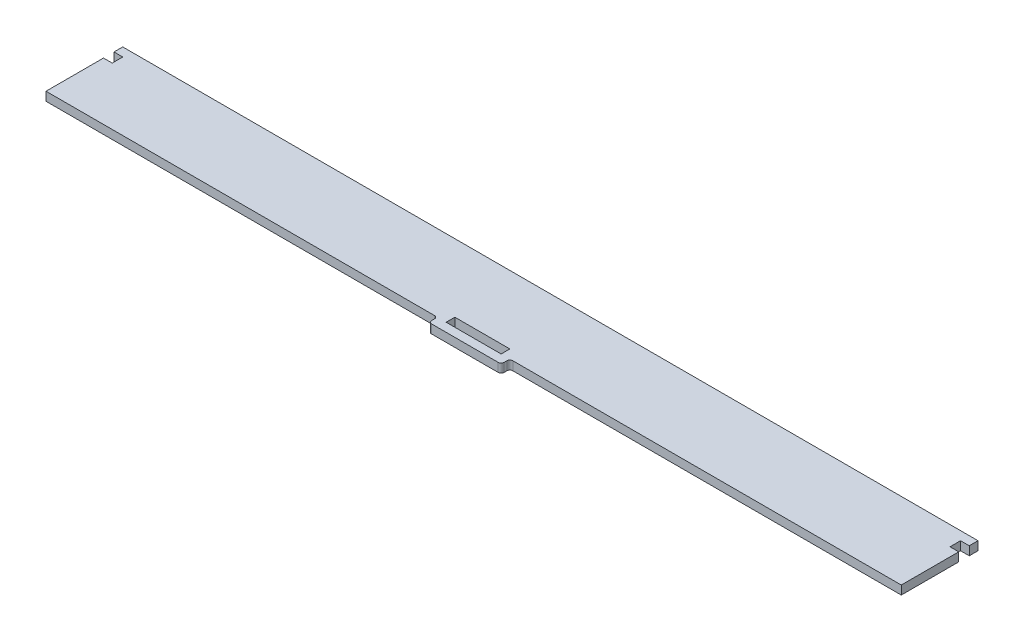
ISO-10303-21;
HEADER;
FILE_DESCRIPTION(('STEP AP214'),'2;1');
FILE_NAME('part.step','',(''),(''),'','','');
FILE_SCHEMA(('AUTOMOTIVE_DESIGN { 1 0 10303 214 1 1 1 1 }'));
ENDSEC;
DATA;
#1=APPLICATION_CONTEXT('core data for automotive mechanical design processes');
#2=APPLICATION_PROTOCOL_DEFINITION('international standard','automotive_design',2000,#1);
#3=PRODUCT_CONTEXT('',#1,'mechanical');
#4=PRODUCT('Part','Part','',(#3));
#5=PRODUCT_RELATED_PRODUCT_CATEGORY('part','',(#4));
#6=PRODUCT_DEFINITION_FORMATION('','',#4);
#7=PRODUCT_DEFINITION_CONTEXT('part definition',#1,'design');
#8=PRODUCT_DEFINITION('design','',#6,#7);
#9=PRODUCT_DEFINITION_SHAPE('','',#8);
#10=(LENGTH_UNIT() NAMED_UNIT(*) SI_UNIT(.MILLI.,.METRE.));
#11=(NAMED_UNIT(*) PLANE_ANGLE_UNIT() SI_UNIT($,.RADIAN.));
#12=(NAMED_UNIT(*) SI_UNIT($,.STERADIAN.) SOLID_ANGLE_UNIT());
#13=UNCERTAINTY_MEASURE_WITH_UNIT(LENGTH_MEASURE(1.E-05),#10,'distance_accuracy_value','');
#14=(GEOMETRIC_REPRESENTATION_CONTEXT(3) GLOBAL_UNCERTAINTY_ASSIGNED_CONTEXT((#13)) GLOBAL_UNIT_ASSIGNED_CONTEXT((#10,
#11,#12)) REPRESENTATION_CONTEXT('',''));
#15=CARTESIAN_POINT('',(0.,0.,0.));
#16=DIRECTION('',(0.,0.,1.));
#17=DIRECTION('',(1.,0.,0.));
#18=AXIS2_PLACEMENT_3D('',#15,#16,#17);
#19=CARTESIAN_POINT('',(14.2333333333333,3.175,2.64583333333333));
#20=DIRECTION('',(0.,1.,0.));
#21=DIRECTION('',(0.,0.,1.));
#22=AXIS2_PLACEMENT_3D('',#19,#20,#21);
#23=PLANE('',#22);
#24=DIRECTION('',(0.,0.,1.));
#25=VECTOR('',#24,1.);
#26=CARTESIAN_POINT('',(-155.575,3.175,1.58750000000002));
#27=LINE('',#26,#25);
#28=CARTESIAN_POINT('',(-155.575,3.175,-19.3223719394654));
#29=VERTEX_POINT('',#28);
#30=CARTESIAN_POINT('',(-155.575,3.175,1.58750000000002));
#31=VERTEX_POINT('',#30);
#32=EDGE_CURVE('E230',#29,#31,#27,.T.);
#33=ORIENTED_EDGE('',*,*,#32,.T.);
#34=DIRECTION('',(1.,0.,0.));
#35=VECTOR('',#34,1.);
#36=CARTESIAN_POINT('',(-14.2333333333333,3.175,1.5875));
#37=LINE('',#36,#35);
#38=CARTESIAN_POINT('',(-14.2333333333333,3.175,1.5875));
#39=VERTEX_POINT('',#38);
#40=EDGE_CURVE('E233',#31,#39,#37,.T.);
#41=ORIENTED_EDGE('',*,*,#40,.T.);
#42=CARTESIAN_POINT('',(-14.2333333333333,3.175,2.64583333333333));
#43=DIRECTION('',(0.,-1.,0.));
#44=DIRECTION('',(0.,0.,-1.));
#45=AXIS2_PLACEMENT_3D('',#42,#43,#44);
#46=CIRCLE('',#45,1.05833333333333);
#47=CARTESIAN_POINT('',(-13.175,3.175,2.64583333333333));
#48=VERTEX_POINT('',#47);
#49=EDGE_CURVE('E236',#39,#48,#46,.T.);
#50=ORIENTED_EDGE('',*,*,#49,.T.);
#51=DIRECTION('',(0.,0.,1.));
#52=VECTOR('',#51,1.);
#53=CARTESIAN_POINT('',(-13.175,3.175,2.64583333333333));
#54=LINE('',#53,#52);
#55=CARTESIAN_POINT('',(-13.175,3.175,3.70416666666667));
#56=VERTEX_POINT('',#55);
#57=EDGE_CURVE('E238',#48,#56,#54,.T.);
#58=ORIENTED_EDGE('',*,*,#57,.T.);
#59=CARTESIAN_POINT('',(-12.1166666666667,3.175,3.70416666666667));
#60=DIRECTION('',(0.,1.,0.));
#61=DIRECTION('',(0.,0.,1.));
#62=AXIS2_PLACEMENT_3D('',#59,#60,#61);
#63=CIRCLE('',#62,1.05833333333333);
#64=CARTESIAN_POINT('',(-12.1166666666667,3.175,4.7625));
#65=VERTEX_POINT('',#64);
#66=EDGE_CURVE('E240',#56,#65,#63,.T.);
#67=ORIENTED_EDGE('',*,*,#66,.T.);
#68=DIRECTION('',(1.,0.,0.));
#69=VECTOR('',#68,1.);
#70=CARTESIAN_POINT('',(-12.1166666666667,3.175,4.7625));
#71=LINE('',#70,#69);
#72=CARTESIAN_POINT('',(12.1166666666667,3.175,4.7625));
#73=VERTEX_POINT('',#72);
#74=EDGE_CURVE('E242',#65,#73,#71,.T.);
#75=ORIENTED_EDGE('',*,*,#74,.T.);
#76=CARTESIAN_POINT('',(12.1166666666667,3.175,3.70416666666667));
#77=DIRECTION('',(0.,1.,0.));
#78=DIRECTION('',(0.,0.,1.));
#79=AXIS2_PLACEMENT_3D('',#76,#77,#78);
#80=CIRCLE('',#79,1.05833333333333);
#81=CARTESIAN_POINT('',(13.175,3.175,3.70416666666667));
#82=VERTEX_POINT('',#81);
#83=EDGE_CURVE('E244',#73,#82,#80,.T.);
#84=ORIENTED_EDGE('',*,*,#83,.T.);
#85=DIRECTION('',(0.,0.,-1.));
#86=VECTOR('',#85,1.);
#87=CARTESIAN_POINT('',(13.175,3.175,2.64583333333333));
#88=LINE('',#87,#86);
#89=CARTESIAN_POINT('',(13.175,3.175,2.64583333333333));
#90=VERTEX_POINT('',#89);
#91=EDGE_CURVE('E246',#82,#90,#88,.T.);
#92=ORIENTED_EDGE('',*,*,#91,.T.);
#93=CARTESIAN_POINT('',(14.2333333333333,3.175,2.64583333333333));
#94=DIRECTION('',(0.,-1.,0.));
#95=DIRECTION('',(0.,0.,1.));
#96=AXIS2_PLACEMENT_3D('',#93,#94,#95);
#97=CIRCLE('',#96,1.05833333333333);
#98=CARTESIAN_POINT('',(14.2333333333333,3.175,1.5875));
#99=VERTEX_POINT('',#98);
#100=EDGE_CURVE('E248',#90,#99,#97,.T.);
#101=ORIENTED_EDGE('',*,*,#100,.T.);
#102=DIRECTION('',(1.,0.,0.));
#103=VECTOR('',#102,1.);
#104=CARTESIAN_POINT('',(155.575,3.175,1.58750000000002));
#105=LINE('',#104,#103);
#106=CARTESIAN_POINT('',(155.575,3.175,1.58750000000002));
#107=VERTEX_POINT('',#106);
#108=EDGE_CURVE('E250',#99,#107,#105,.T.);
#109=ORIENTED_EDGE('',*,*,#108,.T.);
#110=DIRECTION('',(0.,0.,-1.));
#111=VECTOR('',#110,1.);
#112=CARTESIAN_POINT('',(155.575,3.175,-19.3223719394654));
#113=LINE('',#112,#111);
#114=CARTESIAN_POINT('',(155.575,3.175,-19.3223719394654));
#115=VERTEX_POINT('',#114);
#116=EDGE_CURVE('E252',#107,#115,#113,.T.);
#117=ORIENTED_EDGE('',*,*,#116,.T.);
#118=DIRECTION('',(-1.,0.,0.));
#119=VECTOR('',#118,1.);
#120=CARTESIAN_POINT('',(152.4,3.175,-19.3223719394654));
#121=LINE('',#120,#119);
#122=CARTESIAN_POINT('',(152.4,3.175,-19.3223719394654));
#123=VERTEX_POINT('',#122);
#124=EDGE_CURVE('E254',#115,#123,#121,.T.);
#125=ORIENTED_EDGE('',*,*,#124,.T.);
#126=DIRECTION('',(0.,0.,-1.));
#127=VECTOR('',#126,1.);
#128=CARTESIAN_POINT('',(152.4,3.175,-23.1549359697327));
#129=LINE('',#128,#127);
#130=CARTESIAN_POINT('',(152.4,3.175,-23.1549359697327));
#131=VERTEX_POINT('',#130);
#132=EDGE_CURVE('E256',#123,#131,#129,.T.);
#133=ORIENTED_EDGE('',*,*,#132,.T.);
#134=DIRECTION('',(1.,0.,0.));
#135=VECTOR('',#134,1.);
#136=CARTESIAN_POINT('',(155.575,3.175,-23.1549359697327));
#137=LINE('',#136,#135);
#138=CARTESIAN_POINT('',(155.575,3.175,-23.1549359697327));
#139=VERTEX_POINT('',#138);
#140=EDGE_CURVE('E258',#131,#139,#137,.T.);
#141=ORIENTED_EDGE('',*,*,#140,.T.);
#142=DIRECTION('',(0.,0.,-1.));
#143=VECTOR('',#142,1.);
#144=CARTESIAN_POINT('',(155.575,3.175,-26.3299359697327));
#145=LINE('',#144,#143);
#146=CARTESIAN_POINT('',(155.575,3.175,-26.3299359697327));
#147=VERTEX_POINT('',#146);
#148=EDGE_CURVE('E260',#139,#147,#145,.T.);
#149=ORIENTED_EDGE('',*,*,#148,.T.);
#150=DIRECTION('',(-1.,0.,0.));
#151=VECTOR('',#150,1.);
#152=CARTESIAN_POINT('',(152.4,3.175,-26.3299359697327));
#153=LINE('',#152,#151);
#154=CARTESIAN_POINT('',(-155.575,3.175,-26.3299359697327));
#155=VERTEX_POINT('',#154);
#156=EDGE_CURVE('E262',#147,#155,#153,.T.);
#157=ORIENTED_EDGE('',*,*,#156,.T.);
#158=DIRECTION('',(0.,0.,1.));
#159=VECTOR('',#158,1.);
#160=CARTESIAN_POINT('',(-155.575,3.175,-26.3299359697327));
#161=LINE('',#160,#159);
#162=CARTESIAN_POINT('',(-155.575,3.175,-23.1549359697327));
#163=VERTEX_POINT('',#162);
#164=EDGE_CURVE('E264',#155,#163,#161,.T.);
#165=ORIENTED_EDGE('',*,*,#164,.T.);
#166=DIRECTION('',(1.,0.,0.));
#167=VECTOR('',#166,1.);
#168=CARTESIAN_POINT('',(-155.575,3.175,-23.1549359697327));
#169=LINE('',#168,#167);
#170=CARTESIAN_POINT('',(-152.4,3.175,-23.1549359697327));
#171=VERTEX_POINT('',#170);
#172=EDGE_CURVE('E266',#163,#171,#169,.T.);
#173=ORIENTED_EDGE('',*,*,#172,.T.);
#174=DIRECTION('',(0.,0.,1.));
#175=VECTOR('',#174,1.);
#176=CARTESIAN_POINT('',(-152.4,3.175,-23.1549359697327));
#177=LINE('',#176,#175);
#178=CARTESIAN_POINT('',(-152.4,3.175,-19.3223719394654));
#179=VERTEX_POINT('',#178);
#180=EDGE_CURVE('E268',#171,#179,#177,.T.);
#181=ORIENTED_EDGE('',*,*,#180,.T.);
#182=DIRECTION('',(-1.,0.,0.));
#183=VECTOR('',#182,1.);
#184=CARTESIAN_POINT('',(-155.575,3.175,-19.3223719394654));
#185=LINE('',#184,#183);
#186=EDGE_CURVE('E270',#179,#29,#185,.T.);
#187=ORIENTED_EDGE('',*,*,#186,.T.);
#188=EDGE_LOOP('',(#33,#41,#50,#58,#67,#75,#84,#92,#101,#109,#117,#125,#133,#141,#149,#157,#165,
#173,#181,#187));
#189=FACE_BOUND('',#188,.T.);
#190=DIRECTION('',(-1.,0.,0.));
#191=VECTOR('',#190,1.);
#192=CARTESIAN_POINT('',(-10.,3.175,-1.5875));
#193=LINE('',#192,#191);
#194=CARTESIAN_POINT('',(10.,3.175,-1.5875));
#195=VERTEX_POINT('',#194);
#196=CARTESIAN_POINT('',(-10.,3.175,-1.5875));
#197=VERTEX_POINT('',#196);
#198=EDGE_CURVE('E202',#195,#197,#193,.T.);
#199=ORIENTED_EDGE('',*,*,#198,.F.);
#200=DIRECTION('',(0.,0.,-1.));
#201=VECTOR('',#200,1.);
#202=CARTESIAN_POINT('',(10.,3.175,1.5875));
#203=LINE('',#202,#201);
#204=CARTESIAN_POINT('',(10.,3.175,1.5875));
#205=VERTEX_POINT('',#204);
#206=EDGE_CURVE('E194',#205,#195,#203,.T.);
#207=ORIENTED_EDGE('',*,*,#206,.F.);
#208=DIRECTION('',(1.,0.,0.));
#209=VECTOR('',#208,1.);
#210=CARTESIAN_POINT('',(-10.,3.175,1.5875));
#211=LINE('',#210,#209);
#212=CARTESIAN_POINT('',(-10.,3.175,1.5875));
#213=VERTEX_POINT('',#212);
#214=EDGE_CURVE('E216',#213,#205,#211,.T.);
#215=ORIENTED_EDGE('',*,*,#214,.F.);
#216=DIRECTION('',(0.,0.,1.));
#217=VECTOR('',#216,1.);
#218=CARTESIAN_POINT('',(-10.,3.175,1.5875));
#219=LINE('',#218,#217);
#220=EDGE_CURVE('E214',#197,#213,#219,.T.);
#221=ORIENTED_EDGE('',*,*,#220,.F.);
#222=EDGE_LOOP('',(#199,#207,#215,#221));
#223=FACE_BOUND('',#222,.T.);
#224=ADVANCED_FACE('F33',(#189,#223),#23,.T.);
#225=CARTESIAN_POINT('',(14.2333333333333,0.,2.64583333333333));
#226=DIRECTION('',(0.,1.,0.));
#227=DIRECTION('',(0.,0.,1.));
#228=AXIS2_PLACEMENT_3D('',#225,#226,#227);
#229=PLANE('',#228);
#230=DIRECTION('',(0.,0.,1.));
#231=VECTOR('',#230,1.);
#232=CARTESIAN_POINT('',(-155.575,0.,1.58750000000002));
#233=LINE('',#232,#231);
#234=CARTESIAN_POINT('',(-155.575,0.,-19.3223719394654));
#235=VERTEX_POINT('',#234);
#236=CARTESIAN_POINT('',(-155.575,0.,1.58750000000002));
#237=VERTEX_POINT('',#236);
#238=EDGE_CURVE('E210',#235,#237,#233,.T.);
#239=ORIENTED_EDGE('',*,*,#238,.F.);
#240=DIRECTION('',(-1.,0.,0.));
#241=VECTOR('',#240,1.);
#242=CARTESIAN_POINT('',(-155.575,0.,-19.3223719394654));
#243=LINE('',#242,#241);
#244=CARTESIAN_POINT('',(-152.4,0.,-19.3223719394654));
#245=VERTEX_POINT('',#244);
#246=EDGE_CURVE('E234',#245,#235,#243,.T.);
#247=ORIENTED_EDGE('',*,*,#246,.F.);
#248=DIRECTION('',(0.,0.,1.));
#249=VECTOR('',#248,1.);
#250=CARTESIAN_POINT('',(-152.4,0.,-23.1549359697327));
#251=LINE('',#250,#249);
#252=CARTESIAN_POINT('',(-152.4,0.,-23.1549359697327));
#253=VERTEX_POINT('',#252);
#254=EDGE_CURVE('E310',#253,#245,#251,.T.);
#255=ORIENTED_EDGE('',*,*,#254,.F.);
#256=DIRECTION('',(1.,0.,0.));
#257=VECTOR('',#256,1.);
#258=CARTESIAN_POINT('',(-155.575,0.,-23.1549359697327));
#259=LINE('',#258,#257);
#260=CARTESIAN_POINT('',(-155.575,0.,-23.1549359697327));
#261=VERTEX_POINT('',#260);
#262=EDGE_CURVE('E308',#261,#253,#259,.T.);
#263=ORIENTED_EDGE('',*,*,#262,.F.);
#264=DIRECTION('',(0.,0.,1.));
#265=VECTOR('',#264,1.);
#266=CARTESIAN_POINT('',(-155.575,0.,-26.3299359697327));
#267=LINE('',#266,#265);
#268=CARTESIAN_POINT('',(-155.575,0.,-26.3299359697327));
#269=VERTEX_POINT('',#268);
#270=EDGE_CURVE('E306',#269,#261,#267,.T.);
#271=ORIENTED_EDGE('',*,*,#270,.F.);
#272=DIRECTION('',(-1.,0.,0.));
#273=VECTOR('',#272,1.);
#274=CARTESIAN_POINT('',(-152.4,0.,-26.3299359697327));
#275=LINE('',#274,#273);
#276=CARTESIAN_POINT('',(155.575,0.,-26.3299359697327));
#277=VERTEX_POINT('',#276);
#278=EDGE_CURVE('E304',#277,#269,#275,.T.);
#279=ORIENTED_EDGE('',*,*,#278,.F.);
#280=DIRECTION('',(0.,0.,-1.));
#281=VECTOR('',#280,1.);
#282=CARTESIAN_POINT('',(155.575,0.,-26.3299359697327));
#283=LINE('',#282,#281);
#284=CARTESIAN_POINT('',(155.575,0.,-23.1549359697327));
#285=VERTEX_POINT('',#284);
#286=EDGE_CURVE('E301',#285,#277,#283,.T.);
#287=ORIENTED_EDGE('',*,*,#286,.F.);
#288=DIRECTION('',(1.,0.,0.));
#289=VECTOR('',#288,1.);
#290=CARTESIAN_POINT('',(155.575,0.,-23.1549359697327));
#291=LINE('',#290,#289);
#292=CARTESIAN_POINT('',(152.4,0.,-23.1549359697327));
#293=VERTEX_POINT('',#292);
#294=EDGE_CURVE('E299',#293,#285,#291,.T.);
#295=ORIENTED_EDGE('',*,*,#294,.F.);
#296=DIRECTION('',(0.,0.,-1.));
#297=VECTOR('',#296,1.);
#298=CARTESIAN_POINT('',(152.4,0.,-23.1549359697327));
#299=LINE('',#298,#297);
#300=CARTESIAN_POINT('',(152.4,0.,-19.3223719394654));
#301=VERTEX_POINT('',#300);
#302=EDGE_CURVE('E297',#301,#293,#299,.T.);
#303=ORIENTED_EDGE('',*,*,#302,.F.);
#304=DIRECTION('',(-1.,0.,0.));
#305=VECTOR('',#304,1.);
#306=CARTESIAN_POINT('',(152.4,0.,-19.3223719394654));
#307=LINE('',#306,#305);
#308=CARTESIAN_POINT('',(155.575,0.,-19.3223719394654));
#309=VERTEX_POINT('',#308);
#310=EDGE_CURVE('E295',#309,#301,#307,.T.);
#311=ORIENTED_EDGE('',*,*,#310,.F.);
#312=DIRECTION('',(0.,0.,-1.));
#313=VECTOR('',#312,1.);
#314=CARTESIAN_POINT('',(155.575,0.,-19.3223719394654));
#315=LINE('',#314,#313);
#316=CARTESIAN_POINT('',(155.575,0.,1.58750000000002));
#317=VERTEX_POINT('',#316);
#318=EDGE_CURVE('E293',#317,#309,#315,.T.);
#319=ORIENTED_EDGE('',*,*,#318,.F.);
#320=DIRECTION('',(1.,0.,0.));
#321=VECTOR('',#320,1.);
#322=CARTESIAN_POINT('',(155.575,0.,1.58750000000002));
#323=LINE('',#322,#321);
#324=CARTESIAN_POINT('',(14.2333333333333,0.,1.5875));
#325=VERTEX_POINT('',#324);
#326=EDGE_CURVE('E291',#325,#317,#323,.T.);
#327=ORIENTED_EDGE('',*,*,#326,.F.);
#328=CARTESIAN_POINT('',(14.2333333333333,0.,2.64583333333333));
#329=DIRECTION('',(0.,-1.,0.));
#330=DIRECTION('',(0.,0.,1.));
#331=AXIS2_PLACEMENT_3D('',#328,#329,#330);
#332=CIRCLE('',#331,1.05833333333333);
#333=CARTESIAN_POINT('',(13.175,0.,2.64583333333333));
#334=VERTEX_POINT('',#333);
#335=EDGE_CURVE('E289',#334,#325,#332,.T.);
#336=ORIENTED_EDGE('',*,*,#335,.F.);
#337=DIRECTION('',(0.,0.,-1.));
#338=VECTOR('',#337,1.);
#339=CARTESIAN_POINT('',(13.175,0.,2.64583333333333));
#340=LINE('',#339,#338);
#341=CARTESIAN_POINT('',(13.175,0.,3.70416666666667));
#342=VERTEX_POINT('',#341);
#343=EDGE_CURVE('E287',#342,#334,#340,.T.);
#344=ORIENTED_EDGE('',*,*,#343,.F.);
#345=CARTESIAN_POINT('',(12.1166666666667,0.,3.70416666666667));
#346=DIRECTION('',(0.,1.,0.));
#347=DIRECTION('',(0.,0.,1.));
#348=AXIS2_PLACEMENT_3D('',#345,#346,#347);
#349=CIRCLE('',#348,1.05833333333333);
#350=CARTESIAN_POINT('',(12.1166666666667,0.,4.7625));
#351=VERTEX_POINT('',#350);
#352=EDGE_CURVE('E285',#351,#342,#349,.T.);
#353=ORIENTED_EDGE('',*,*,#352,.F.);
#354=DIRECTION('',(1.,0.,0.));
#355=VECTOR('',#354,1.);
#356=CARTESIAN_POINT('',(-12.1166666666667,0.,4.7625));
#357=LINE('',#356,#355);
#358=CARTESIAN_POINT('',(-12.1166666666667,0.,4.7625));
#359=VERTEX_POINT('',#358);
#360=EDGE_CURVE('E283',#359,#351,#357,.T.);
#361=ORIENTED_EDGE('',*,*,#360,.F.);
#362=CARTESIAN_POINT('',(-12.1166666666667,0.,3.70416666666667));
#363=DIRECTION('',(0.,1.,0.));
#364=DIRECTION('',(0.,0.,1.));
#365=AXIS2_PLACEMENT_3D('',#362,#363,#364);
#366=CIRCLE('',#365,1.05833333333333);
#367=CARTESIAN_POINT('',(-13.175,0.,3.70416666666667));
#368=VERTEX_POINT('',#367);
#369=EDGE_CURVE('E281',#368,#359,#366,.T.);
#370=ORIENTED_EDGE('',*,*,#369,.F.);
#371=DIRECTION('',(0.,0.,1.));
#372=VECTOR('',#371,1.);
#373=CARTESIAN_POINT('',(-13.175,0.,2.64583333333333));
#374=LINE('',#373,#372);
#375=CARTESIAN_POINT('',(-13.175,0.,2.64583333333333));
#376=VERTEX_POINT('',#375);
#377=EDGE_CURVE('E279',#376,#368,#374,.T.);
#378=ORIENTED_EDGE('',*,*,#377,.F.);
#379=CARTESIAN_POINT('',(-14.2333333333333,0.,2.64583333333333));
#380=DIRECTION('',(0.,-1.,0.));
#381=DIRECTION('',(0.,0.,-1.));
#382=AXIS2_PLACEMENT_3D('',#379,#380,#381);
#383=CIRCLE('',#382,1.05833333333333);
#384=CARTESIAN_POINT('',(-14.2333333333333,0.,1.5875));
#385=VERTEX_POINT('',#384);
#386=EDGE_CURVE('E277',#385,#376,#383,.T.);
#387=ORIENTED_EDGE('',*,*,#386,.F.);
#388=DIRECTION('',(1.,0.,0.));
#389=VECTOR('',#388,1.);
#390=CARTESIAN_POINT('',(-14.2333333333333,0.,1.5875));
#391=LINE('',#390,#389);
#392=EDGE_CURVE('E275',#237,#385,#391,.T.);
#393=ORIENTED_EDGE('',*,*,#392,.F.);
#394=EDGE_LOOP('',(#239,#247,#255,#263,#271,#279,#287,#295,#303,#311,#319,#327,#336,#344,#353,
#361,#370,#378,#387,#393));
#395=FACE_BOUND('',#394,.T.);
#396=DIRECTION('',(0.,0.,-1.));
#397=VECTOR('',#396,1.);
#398=CARTESIAN_POINT('',(10.,0.,1.5875));
#399=LINE('',#398,#397);
#400=CARTESIAN_POINT('',(10.,0.,1.5875));
#401=VERTEX_POINT('',#400);
#402=CARTESIAN_POINT('',(10.,0.,-1.5875));
#403=VERTEX_POINT('',#402);
#404=EDGE_CURVE('E56',#401,#403,#399,.T.);
#405=ORIENTED_EDGE('',*,*,#404,.T.);
#406=DIRECTION('',(-1.,0.,0.));
#407=VECTOR('',#406,1.);
#408=CARTESIAN_POINT('',(-10.,0.,-1.5875));
#409=LINE('',#408,#407);
#410=CARTESIAN_POINT('',(-10.,0.,-1.5875));
#411=VERTEX_POINT('',#410);
#412=EDGE_CURVE('E209',#403,#411,#409,.T.);
#413=ORIENTED_EDGE('',*,*,#412,.T.);
#414=DIRECTION('',(0.,0.,1.));
#415=VECTOR('',#414,1.);
#416=CARTESIAN_POINT('',(-10.,0.,1.5875));
#417=LINE('',#416,#415);
#418=CARTESIAN_POINT('',(-10.,0.,1.5875));
#419=VERTEX_POINT('',#418);
#420=EDGE_CURVE('E222',#411,#419,#417,.T.);
#421=ORIENTED_EDGE('',*,*,#420,.T.);
#422=DIRECTION('',(1.,0.,0.));
#423=VECTOR('',#422,1.);
#424=CARTESIAN_POINT('',(-10.,0.,1.5875));
#425=LINE('',#424,#423);
#426=EDGE_CURVE('E203',#419,#401,#425,.T.);
#427=ORIENTED_EDGE('',*,*,#426,.T.);
#428=EDGE_LOOP('',(#405,#413,#421,#427));
#429=FACE_BOUND('',#428,.T.);
#430=ADVANCED_FACE('F376',(#395,#429),#229,.F.);
#431=CARTESIAN_POINT('',(-155.575,3.175,1.58750000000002));
#432=DIRECTION('',(1.,0.,0.));
#433=DIRECTION('',(0.,0.,-1.));
#434=AXIS2_PLACEMENT_3D('',#431,#432,#433);
#435=PLANE('',#434);
#436=ORIENTED_EDGE('',*,*,#238,.T.);
#437=DIRECTION('',(0.,-1.,0.));
#438=VECTOR('',#437,1.);
#439=CARTESIAN_POINT('',(-155.575,3.175,1.58750000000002));
#440=LINE('',#439,#438);
#441=EDGE_CURVE('E11',#31,#237,#440,.T.);
#442=ORIENTED_EDGE('',*,*,#441,.F.);
#443=ORIENTED_EDGE('',*,*,#32,.F.);
#444=DIRECTION('',(0.,-1.,0.));
#445=VECTOR('',#444,1.);
#446=CARTESIAN_POINT('',(-155.575,3.175,-19.3223719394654));
#447=LINE('',#446,#445);
#448=EDGE_CURVE('E272',#29,#235,#447,.T.);
#449=ORIENTED_EDGE('',*,*,#448,.T.);
#450=EDGE_LOOP('',(#436,#442,#443,#449));
#451=FACE_BOUND('',#450,.T.);
#452=ADVANCED_FACE('F35',(#451),#435,.F.);
#453=CARTESIAN_POINT('',(-14.2333333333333,3.175,1.5875));
#454=DIRECTION('',(0.,0.,-1.));
#455=DIRECTION('',(-1.,0.,0.));
#456=AXIS2_PLACEMENT_3D('',#453,#454,#455);
#457=PLANE('',#456);
#458=ORIENTED_EDGE('',*,*,#392,.T.);
#459=DIRECTION('',(0.,-1.,0.));
#460=VECTOR('',#459,1.);
#461=CARTESIAN_POINT('',(-14.2333333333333,3.175,1.5875));
#462=LINE('',#461,#460);
#463=EDGE_CURVE('E41',#39,#385,#462,.T.);
#464=ORIENTED_EDGE('',*,*,#463,.F.);
#465=ORIENTED_EDGE('',*,*,#40,.F.);
#466=ORIENTED_EDGE('',*,*,#441,.T.);
#467=EDGE_LOOP('',(#458,#464,#465,#466));
#468=FACE_BOUND('',#467,.T.);
#469=ADVANCED_FACE('F393',(#468),#457,.F.);
#470=CARTESIAN_POINT('',(-14.2333333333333,3.175,2.64583333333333));
#471=DIRECTION('',(0.,-1.,0.));
#472=DIRECTION('',(0.,0.,-1.));
#473=AXIS2_PLACEMENT_3D('',#470,#471,#472);
#474=CYLINDRICAL_SURFACE('',#473,1.05833333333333);
#475=ORIENTED_EDGE('',*,*,#386,.T.);
#476=DIRECTION('',(0.,-1.,0.));
#477=VECTOR('',#476,1.);
#478=CARTESIAN_POINT('',(-13.175,3.175,2.64583333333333));
#479=LINE('',#478,#477);
#480=EDGE_CURVE('E363',#48,#376,#479,.T.);
#481=ORIENTED_EDGE('',*,*,#480,.F.);
#482=ORIENTED_EDGE('',*,*,#49,.F.);
#483=ORIENTED_EDGE('',*,*,#463,.T.);
#484=EDGE_LOOP('',(#475,#481,#482,#483));
#485=FACE_BOUND('',#484,.T.);
#486=ADVANCED_FACE('F370',(#485),#474,.F.);
#487=CARTESIAN_POINT('',(-13.175,3.175,2.64583333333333));
#488=DIRECTION('',(1.,0.,0.));
#489=DIRECTION('',(0.,0.,-1.));
#490=AXIS2_PLACEMENT_3D('',#487,#488,#489);
#491=PLANE('',#490);
#492=ORIENTED_EDGE('',*,*,#377,.T.);
#493=DIRECTION('',(0.,-1.,0.));
#494=VECTOR('',#493,1.);
#495=CARTESIAN_POINT('',(-13.175,3.175,3.70416666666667));
#496=LINE('',#495,#494);
#497=EDGE_CURVE('E360',#56,#368,#496,.T.);
#498=ORIENTED_EDGE('',*,*,#497,.F.);
#499=ORIENTED_EDGE('',*,*,#57,.F.);
#500=ORIENTED_EDGE('',*,*,#480,.T.);
#501=EDGE_LOOP('',(#492,#498,#499,#500));
#502=FACE_BOUND('',#501,.T.);
#503=ADVANCED_FACE('F382',(#502),#491,.F.);
#504=CARTESIAN_POINT('',(-12.1166666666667,3.175,3.70416666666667));
#505=DIRECTION('',(0.,-1.,0.));
#506=DIRECTION('',(0.,0.,-1.));
#507=AXIS2_PLACEMENT_3D('',#504,#505,#506);
#508=CYLINDRICAL_SURFACE('',#507,1.05833333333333);
#509=ORIENTED_EDGE('',*,*,#369,.T.);
#510=DIRECTION('',(0.,-1.,0.));
#511=VECTOR('',#510,1.);
#512=CARTESIAN_POINT('',(-12.1166666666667,3.175,4.7625));
#513=LINE('',#512,#511);
#514=EDGE_CURVE('E357',#65,#359,#513,.T.);
#515=ORIENTED_EDGE('',*,*,#514,.F.);
#516=ORIENTED_EDGE('',*,*,#66,.F.);
#517=ORIENTED_EDGE('',*,*,#497,.T.);
#518=EDGE_LOOP('',(#509,#515,#516,#517));
#519=FACE_BOUND('',#518,.T.);
#520=ADVANCED_FACE('F386',(#519),#508,.T.);
#521=CARTESIAN_POINT('',(-12.1166666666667,3.175,4.7625));
#522=DIRECTION('',(0.,0.,-1.));
#523=DIRECTION('',(-1.,0.,0.));
#524=AXIS2_PLACEMENT_3D('',#521,#522,#523);
#525=PLANE('',#524);
#526=ORIENTED_EDGE('',*,*,#360,.T.);
#527=DIRECTION('',(0.,-1.,0.));
#528=VECTOR('',#527,1.);
#529=CARTESIAN_POINT('',(12.1166666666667,3.175,4.7625));
#530=LINE('',#529,#528);
#531=EDGE_CURVE('E354',#73,#351,#530,.T.);
#532=ORIENTED_EDGE('',*,*,#531,.F.);
#533=ORIENTED_EDGE('',*,*,#74,.F.);
#534=ORIENTED_EDGE('',*,*,#514,.T.);
#535=EDGE_LOOP('',(#526,#532,#533,#534));
#536=FACE_BOUND('',#535,.T.);
#537=ADVANCED_FACE('F465',(#536),#525,.F.);
#538=CARTESIAN_POINT('',(12.1166666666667,3.175,3.70416666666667));
#539=DIRECTION('',(0.,-1.,0.));
#540=DIRECTION('',(0.,0.,-1.));
#541=AXIS2_PLACEMENT_3D('',#538,#539,#540);
#542=CYLINDRICAL_SURFACE('',#541,1.05833333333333);
#543=ORIENTED_EDGE('',*,*,#352,.T.);
#544=DIRECTION('',(0.,-1.,0.));
#545=VECTOR('',#544,1.);
#546=CARTESIAN_POINT('',(13.175,3.175,3.70416666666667));
#547=LINE('',#546,#545);
#548=EDGE_CURVE('E351',#82,#342,#547,.T.);
#549=ORIENTED_EDGE('',*,*,#548,.F.);
#550=ORIENTED_EDGE('',*,*,#83,.F.);
#551=ORIENTED_EDGE('',*,*,#531,.T.);
#552=EDGE_LOOP('',(#543,#549,#550,#551));
#553=FACE_BOUND('',#552,.T.);
#554=ADVANCED_FACE('F463',(#553),#542,.T.);
#555=CARTESIAN_POINT('',(13.175,3.175,2.64583333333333));
#556=DIRECTION('',(-1.,0.,0.));
#557=DIRECTION('',(0.,0.,1.));
#558=AXIS2_PLACEMENT_3D('',#555,#556,#557);
#559=PLANE('',#558);
#560=ORIENTED_EDGE('',*,*,#343,.T.);
#561=DIRECTION('',(0.,-1.,0.));
#562=VECTOR('',#561,1.);
#563=CARTESIAN_POINT('',(13.175,3.175,2.64583333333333));
#564=LINE('',#563,#562);
#565=EDGE_CURVE('E348',#90,#334,#564,.T.);
#566=ORIENTED_EDGE('',*,*,#565,.F.);
#567=ORIENTED_EDGE('',*,*,#91,.F.);
#568=ORIENTED_EDGE('',*,*,#548,.T.);
#569=EDGE_LOOP('',(#560,#566,#567,#568));
#570=FACE_BOUND('',#569,.T.);
#571=ADVANCED_FACE('F458',(#570),#559,.F.);
#572=CARTESIAN_POINT('',(14.2333333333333,3.175,2.64583333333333));
#573=DIRECTION('',(0.,-1.,0.));
#574=DIRECTION('',(0.,0.,-1.));
#575=AXIS2_PLACEMENT_3D('',#572,#573,#574);
#576=CYLINDRICAL_SURFACE('',#575,1.05833333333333);
#577=ORIENTED_EDGE('',*,*,#335,.T.);
#578=DIRECTION('',(0.,-1.,0.));
#579=VECTOR('',#578,1.);
#580=CARTESIAN_POINT('',(14.2333333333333,3.175,1.5875));
#581=LINE('',#580,#579);
#582=EDGE_CURVE('E345',#99,#325,#581,.T.);
#583=ORIENTED_EDGE('',*,*,#582,.F.);
#584=ORIENTED_EDGE('',*,*,#100,.F.);
#585=ORIENTED_EDGE('',*,*,#565,.T.);
#586=EDGE_LOOP('',(#577,#583,#584,#585));
#587=FACE_BOUND('',#586,.T.);
#588=ADVANCED_FACE('F453',(#587),#576,.F.);
#589=CARTESIAN_POINT('',(155.575,3.175,1.58750000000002));
#590=DIRECTION('',(0.,0.,-1.));
#591=DIRECTION('',(-1.,0.,0.));
#592=AXIS2_PLACEMENT_3D('',#589,#590,#591);
#593=PLANE('',#592);
#594=ORIENTED_EDGE('',*,*,#326,.T.);
#595=DIRECTION('',(0.,-1.,0.));
#596=VECTOR('',#595,1.);
#597=CARTESIAN_POINT('',(155.575,3.175,1.58750000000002));
#598=LINE('',#597,#596);
#599=EDGE_CURVE('E342',#107,#317,#598,.T.);
#600=ORIENTED_EDGE('',*,*,#599,.F.);
#601=ORIENTED_EDGE('',*,*,#108,.F.);
#602=ORIENTED_EDGE('',*,*,#582,.T.);
#603=EDGE_LOOP('',(#594,#600,#601,#602));
#604=FACE_BOUND('',#603,.T.);
#605=ADVANCED_FACE('F449',(#604),#593,.F.);
#606=CARTESIAN_POINT('',(155.575,3.175,-19.3223719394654));
#607=DIRECTION('',(-1.,0.,0.));
#608=DIRECTION('',(0.,0.,1.));
#609=AXIS2_PLACEMENT_3D('',#606,#607,#608);
#610=PLANE('',#609);
#611=ORIENTED_EDGE('',*,*,#318,.T.);
#612=DIRECTION('',(0.,-1.,0.));
#613=VECTOR('',#612,1.);
#614=CARTESIAN_POINT('',(155.575,3.175,-19.3223719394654));
#615=LINE('',#614,#613);
#616=EDGE_CURVE('E339',#115,#309,#615,.T.);
#617=ORIENTED_EDGE('',*,*,#616,.F.);
#618=ORIENTED_EDGE('',*,*,#116,.F.);
#619=ORIENTED_EDGE('',*,*,#599,.T.);
#620=EDGE_LOOP('',(#611,#617,#618,#619));
#621=FACE_BOUND('',#620,.T.);
#622=ADVANCED_FACE('F444',(#621),#610,.F.);
#623=CARTESIAN_POINT('',(152.4,3.175,-19.3223719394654));
#624=DIRECTION('',(0.,0.,1.));
#625=DIRECTION('',(1.,0.,0.));
#626=AXIS2_PLACEMENT_3D('',#623,#624,#625);
#627=PLANE('',#626);
#628=ORIENTED_EDGE('',*,*,#310,.T.);
#629=DIRECTION('',(0.,-1.,0.));
#630=VECTOR('',#629,1.);
#631=CARTESIAN_POINT('',(152.4,3.175,-19.3223719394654));
#632=LINE('',#631,#630);
#633=EDGE_CURVE('E336',#123,#301,#632,.T.);
#634=ORIENTED_EDGE('',*,*,#633,.F.);
#635=ORIENTED_EDGE('',*,*,#124,.F.);
#636=ORIENTED_EDGE('',*,*,#616,.T.);
#637=EDGE_LOOP('',(#628,#634,#635,#636));
#638=FACE_BOUND('',#637,.T.);
#639=ADVANCED_FACE('F438',(#638),#627,.F.);
#640=CARTESIAN_POINT('',(152.4,3.175,-23.1549359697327));
#641=DIRECTION('',(-1.,0.,0.));
#642=DIRECTION('',(0.,0.,1.));
#643=AXIS2_PLACEMENT_3D('',#640,#641,#642);
#644=PLANE('',#643);
#645=ORIENTED_EDGE('',*,*,#302,.T.);
#646=DIRECTION('',(0.,-1.,0.));
#647=VECTOR('',#646,1.);
#648=CARTESIAN_POINT('',(152.4,3.175,-23.1549359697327));
#649=LINE('',#648,#647);
#650=EDGE_CURVE('E333',#131,#293,#649,.T.);
#651=ORIENTED_EDGE('',*,*,#650,.F.);
#652=ORIENTED_EDGE('',*,*,#132,.F.);
#653=ORIENTED_EDGE('',*,*,#633,.T.);
#654=EDGE_LOOP('',(#645,#651,#652,#653));
#655=FACE_BOUND('',#654,.T.);
#656=ADVANCED_FACE('F434',(#655),#644,.F.);
#657=CARTESIAN_POINT('',(155.575,3.175,-23.1549359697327));
#658=DIRECTION('',(0.,0.,-1.));
#659=DIRECTION('',(-1.,0.,0.));
#660=AXIS2_PLACEMENT_3D('',#657,#658,#659);
#661=PLANE('',#660);
#662=ORIENTED_EDGE('',*,*,#294,.T.);
#663=DIRECTION('',(0.,-1.,0.));
#664=VECTOR('',#663,1.);
#665=CARTESIAN_POINT('',(155.575,3.175,-23.1549359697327));
#666=LINE('',#665,#664);
#667=EDGE_CURVE('E330',#139,#285,#666,.T.);
#668=ORIENTED_EDGE('',*,*,#667,.F.);
#669=ORIENTED_EDGE('',*,*,#140,.F.);
#670=ORIENTED_EDGE('',*,*,#650,.T.);
#671=EDGE_LOOP('',(#662,#668,#669,#670));
#672=FACE_BOUND('',#671,.T.);
#673=ADVANCED_FACE('F429',(#672),#661,.F.);
#674=CARTESIAN_POINT('',(155.575,3.175,-26.3299359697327));
#675=DIRECTION('',(-1.,0.,0.));
#676=DIRECTION('',(0.,0.,1.));
#677=AXIS2_PLACEMENT_3D('',#674,#675,#676);
#678=PLANE('',#677);
#679=ORIENTED_EDGE('',*,*,#286,.T.);
#680=DIRECTION('',(0.,-1.,0.));
#681=VECTOR('',#680,1.);
#682=CARTESIAN_POINT('',(155.575,3.175,-26.3299359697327));
#683=LINE('',#682,#681);
#684=EDGE_CURVE('E327',#147,#277,#683,.T.);
#685=ORIENTED_EDGE('',*,*,#684,.F.);
#686=ORIENTED_EDGE('',*,*,#148,.F.);
#687=ORIENTED_EDGE('',*,*,#667,.T.);
#688=EDGE_LOOP('',(#679,#685,#686,#687));
#689=FACE_BOUND('',#688,.T.);
#690=ADVANCED_FACE('F423',(#689),#678,.F.);
#691=CARTESIAN_POINT('',(-152.4,3.175,-26.3299359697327));
#692=DIRECTION('',(0.,0.,1.));
#693=DIRECTION('',(1.,0.,0.));
#694=AXIS2_PLACEMENT_3D('',#691,#692,#693);
#695=PLANE('',#694);
#696=ORIENTED_EDGE('',*,*,#278,.T.);
#697=DIRECTION('',(0.,-1.,0.));
#698=VECTOR('',#697,1.);
#699=CARTESIAN_POINT('',(-155.575,3.175,-26.3299359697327));
#700=LINE('',#699,#698);
#701=EDGE_CURVE('E324',#155,#269,#700,.T.);
#702=ORIENTED_EDGE('',*,*,#701,.F.);
#703=ORIENTED_EDGE('',*,*,#156,.F.);
#704=ORIENTED_EDGE('',*,*,#684,.T.);
#705=EDGE_LOOP('',(#696,#702,#703,#704));
#706=FACE_BOUND('',#705,.T.);
#707=ADVANCED_FACE('F419',(#706),#695,.F.);
#708=CARTESIAN_POINT('',(-155.575,3.175,-26.3299359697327));
#709=DIRECTION('',(1.,0.,0.));
#710=DIRECTION('',(0.,0.,-1.));
#711=AXIS2_PLACEMENT_3D('',#708,#709,#710);
#712=PLANE('',#711);
#713=ORIENTED_EDGE('',*,*,#270,.T.);
#714=DIRECTION('',(0.,-1.,0.));
#715=VECTOR('',#714,1.);
#716=CARTESIAN_POINT('',(-155.575,3.175,-23.1549359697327));
#717=LINE('',#716,#715);
#718=EDGE_CURVE('E321',#163,#261,#717,.T.);
#719=ORIENTED_EDGE('',*,*,#718,.F.);
#720=ORIENTED_EDGE('',*,*,#164,.F.);
#721=ORIENTED_EDGE('',*,*,#701,.T.);
#722=EDGE_LOOP('',(#713,#719,#720,#721));
#723=FACE_BOUND('',#722,.T.);
#724=ADVANCED_FACE('F414',(#723),#712,.F.);
#725=CARTESIAN_POINT('',(-155.575,3.175,-23.1549359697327));
#726=DIRECTION('',(0.,0.,-1.));
#727=DIRECTION('',(-1.,0.,0.));
#728=AXIS2_PLACEMENT_3D('',#725,#726,#727);
#729=PLANE('',#728);
#730=ORIENTED_EDGE('',*,*,#262,.T.);
#731=DIRECTION('',(0.,-1.,0.));
#732=VECTOR('',#731,1.);
#733=CARTESIAN_POINT('',(-152.4,3.175,-23.1549359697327));
#734=LINE('',#733,#732);
#735=EDGE_CURVE('E318',#171,#253,#734,.T.);
#736=ORIENTED_EDGE('',*,*,#735,.F.);
#737=ORIENTED_EDGE('',*,*,#172,.F.);
#738=ORIENTED_EDGE('',*,*,#718,.T.);
#739=EDGE_LOOP('',(#730,#736,#737,#738));
#740=FACE_BOUND('',#739,.T.);
#741=ADVANCED_FACE('F409',(#740),#729,.F.);
#742=CARTESIAN_POINT('',(-152.4,3.175,-23.1549359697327));
#743=DIRECTION('',(1.,0.,0.));
#744=DIRECTION('',(0.,0.,-1.));
#745=AXIS2_PLACEMENT_3D('',#742,#743,#744);
#746=PLANE('',#745);
#747=ORIENTED_EDGE('',*,*,#254,.T.);
#748=DIRECTION('',(0.,-1.,0.));
#749=VECTOR('',#748,1.);
#750=CARTESIAN_POINT('',(-152.4,3.175,-19.3223719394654));
#751=LINE('',#750,#749);
#752=EDGE_CURVE('E315',#179,#245,#751,.T.);
#753=ORIENTED_EDGE('',*,*,#752,.F.);
#754=ORIENTED_EDGE('',*,*,#180,.F.);
#755=ORIENTED_EDGE('',*,*,#735,.T.);
#756=EDGE_LOOP('',(#747,#753,#754,#755));
#757=FACE_BOUND('',#756,.T.);
#758=ADVANCED_FACE('F405',(#757),#746,.F.);
#759=CARTESIAN_POINT('',(-155.575,3.175,-19.3223719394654));
#760=DIRECTION('',(0.,0.,1.));
#761=DIRECTION('',(1.,0.,0.));
#762=AXIS2_PLACEMENT_3D('',#759,#760,#761);
#763=PLANE('',#762);
#764=ORIENTED_EDGE('',*,*,#246,.T.);
#765=ORIENTED_EDGE('',*,*,#448,.F.);
#766=ORIENTED_EDGE('',*,*,#186,.F.);
#767=ORIENTED_EDGE('',*,*,#752,.T.);
#768=EDGE_LOOP('',(#764,#765,#766,#767));
#769=FACE_BOUND('',#768,.T.);
#770=ADVANCED_FACE('F400',(#769),#763,.F.);
#771=CARTESIAN_POINT('',(10.,3.175,1.5875));
#772=DIRECTION('',(-1.,0.,0.));
#773=DIRECTION('',(0.,0.,1.));
#774=AXIS2_PLACEMENT_3D('',#771,#772,#773);
#775=PLANE('',#774);
#776=ORIENTED_EDGE('',*,*,#404,.F.);
#777=DIRECTION('',(0.,-1.,0.));
#778=VECTOR('',#777,1.);
#779=CARTESIAN_POINT('',(10.,3.175,1.5875));
#780=LINE('',#779,#778);
#781=EDGE_CURVE('E198',#205,#401,#780,.T.);
#782=ORIENTED_EDGE('',*,*,#781,.F.);
#783=ORIENTED_EDGE('',*,*,#206,.T.);
#784=DIRECTION('',(0.,-1.,0.));
#785=VECTOR('',#784,1.);
#786=CARTESIAN_POINT('',(10.,3.175,-1.5875));
#787=LINE('',#786,#785);
#788=EDGE_CURVE('E197',#195,#403,#787,.T.);
#789=ORIENTED_EDGE('',*,*,#788,.T.);
#790=EDGE_LOOP('',(#776,#782,#783,#789));
#791=FACE_BOUND('',#790,.T.);
#792=ADVANCED_FACE('F196',(#791),#775,.T.);
#793=CARTESIAN_POINT('',(-10.,3.175,-1.5875));
#794=DIRECTION('',(0.,0.,1.));
#795=DIRECTION('',(1.,0.,0.));
#796=AXIS2_PLACEMENT_3D('',#793,#794,#795);
#797=PLANE('',#796);
#798=ORIENTED_EDGE('',*,*,#412,.F.);
#799=ORIENTED_EDGE('',*,*,#788,.F.);
#800=ORIENTED_EDGE('',*,*,#198,.T.);
#801=DIRECTION('',(0.,-1.,0.));
#802=VECTOR('',#801,1.);
#803=CARTESIAN_POINT('',(-10.,3.175,-1.5875));
#804=LINE('',#803,#802);
#805=EDGE_CURVE('E211',#197,#411,#804,.T.);
#806=ORIENTED_EDGE('',*,*,#805,.T.);
#807=EDGE_LOOP('',(#798,#799,#800,#806));
#808=FACE_BOUND('',#807,.T.);
#809=ADVANCED_FACE('F206',(#808),#797,.T.);
#810=CARTESIAN_POINT('',(-10.,3.175,1.5875));
#811=DIRECTION('',(1.,0.,0.));
#812=DIRECTION('',(0.,0.,-1.));
#813=AXIS2_PLACEMENT_3D('',#810,#811,#812);
#814=PLANE('',#813);
#815=ORIENTED_EDGE('',*,*,#420,.F.);
#816=ORIENTED_EDGE('',*,*,#805,.F.);
#817=ORIENTED_EDGE('',*,*,#220,.T.);
#818=DIRECTION('',(0.,-1.,0.));
#819=VECTOR('',#818,1.);
#820=CARTESIAN_POINT('',(-10.,3.175,1.5875));
#821=LINE('',#820,#819);
#822=EDGE_CURVE('E48',#213,#419,#821,.T.);
#823=ORIENTED_EDGE('',*,*,#822,.T.);
#824=EDGE_LOOP('',(#815,#816,#817,#823));
#825=FACE_BOUND('',#824,.T.);
#826=ADVANCED_FACE('F571',(#825),#814,.T.);
#827=CARTESIAN_POINT('',(-10.,3.175,1.5875));
#828=DIRECTION('',(0.,0.,-1.));
#829=DIRECTION('',(-1.,0.,0.));
#830=AXIS2_PLACEMENT_3D('',#827,#828,#829);
#831=PLANE('',#830);
#832=ORIENTED_EDGE('',*,*,#426,.F.);
#833=ORIENTED_EDGE('',*,*,#822,.F.);
#834=ORIENTED_EDGE('',*,*,#214,.T.);
#835=ORIENTED_EDGE('',*,*,#781,.T.);
#836=EDGE_LOOP('',(#832,#833,#834,#835));
#837=FACE_BOUND('',#836,.T.);
#838=ADVANCED_FACE('F577',(#837),#831,.T.);
#839=CLOSED_SHELL('',(#224,#430,#452,#469,#486,#503,#520,#537,#554,#571,#588,#605,#622,#639,
#656,#673,#690,#707,#724,#741,#758,#770,#792,#809,#826,#838));
#840=MANIFOLD_SOLID_BREP('B2',#839);
#841=ADVANCED_BREP_SHAPE_REPRESENTATION('',(#18,#840),#14);
#842=SHAPE_DEFINITION_REPRESENTATION(#9,#841);
ENDSEC;
END-ISO-10303-21;
